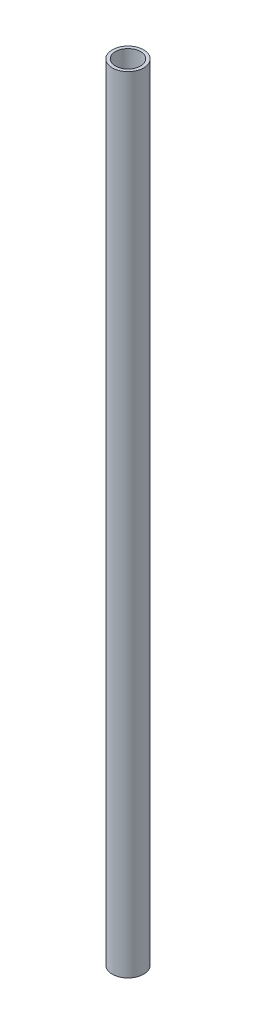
from build123d import *

# Parameters (mm, degrees)
SKETCH1_R           = 5
SKETCH1_R_2         = 4
BOSS_EXTRUDE1_DEPTH = 250


with BuildPart() as part:
    # Sketch1 → Boss-Extrude1 (new body)
    with BuildSketch(Plane(origin=(0, 0, 0), x_dir=(1, 0, 0), z_dir=(0, 1, 0))):
        with Locations(Location((0, 0, 0), (0, 0, 270))):
            Circle(SKETCH1_R)
        with Locations(Location((0, 0, 0), (0, 0, 270))):
            Circle(SKETCH1_R_2, mode=Mode.SUBTRACT)
    extrude(amount=BOSS_EXTRUDE1_DEPTH)


solid = part.part
